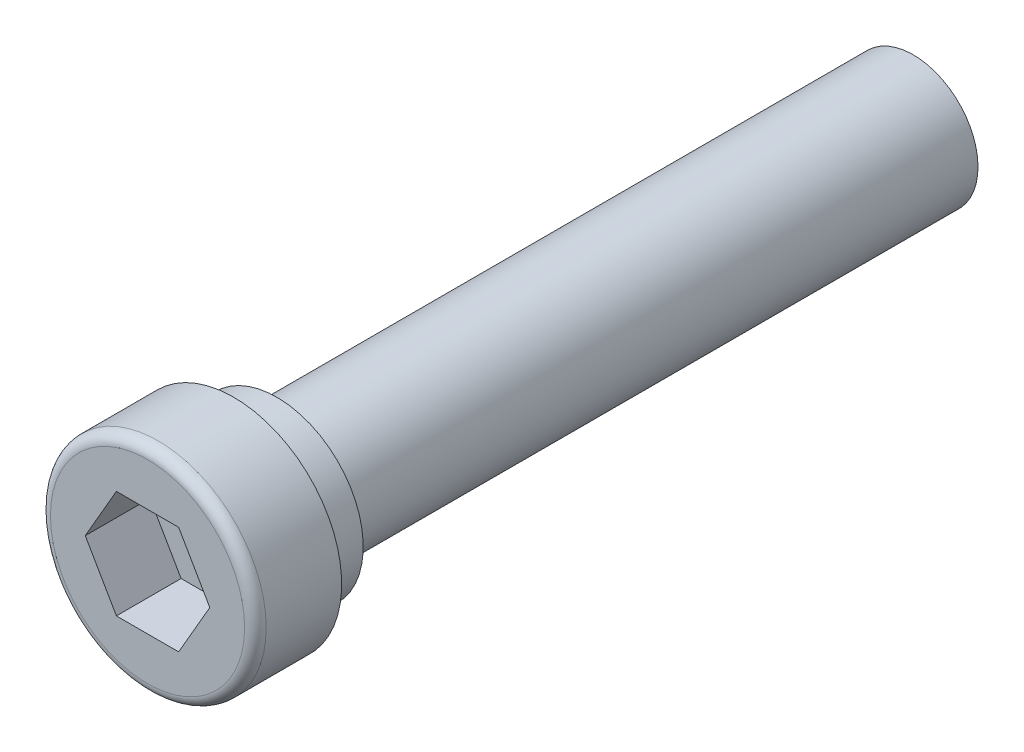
ISO-10303-21;
HEADER;
FILE_DESCRIPTION(('STEP AP214'),'2;1');
FILE_NAME('part.step','',(''),(''),'','','');
FILE_SCHEMA(('AUTOMOTIVE_DESIGN { 1 0 10303 214 1 1 1 1 }'));
ENDSEC;
DATA;
#1=APPLICATION_CONTEXT('core data for automotive mechanical design processes');
#2=APPLICATION_PROTOCOL_DEFINITION('international standard','automotive_design',2000,#1);
#3=PRODUCT_CONTEXT('',#1,'mechanical');
#4=PRODUCT('Part','Part','',(#3));
#5=PRODUCT_RELATED_PRODUCT_CATEGORY('part','',(#4));
#6=PRODUCT_DEFINITION_FORMATION('','',#4);
#7=PRODUCT_DEFINITION_CONTEXT('part definition',#1,'design');
#8=PRODUCT_DEFINITION('design','',#6,#7);
#9=PRODUCT_DEFINITION_SHAPE('','',#8);
#10=(LENGTH_UNIT() NAMED_UNIT(*) SI_UNIT(.MILLI.,.METRE.));
#11=(NAMED_UNIT(*) PLANE_ANGLE_UNIT() SI_UNIT($,.RADIAN.));
#12=(NAMED_UNIT(*) SI_UNIT($,.STERADIAN.) SOLID_ANGLE_UNIT());
#13=UNCERTAINTY_MEASURE_WITH_UNIT(LENGTH_MEASURE(1.E-05),#10,'distance_accuracy_value','');
#14=(GEOMETRIC_REPRESENTATION_CONTEXT(3) GLOBAL_UNCERTAINTY_ASSIGNED_CONTEXT((#13)) GLOBAL_UNIT_ASSIGNED_CONTEXT((#10,
#11,#12)) REPRESENTATION_CONTEXT('',''));
#15=CARTESIAN_POINT('',(0.,0.,0.));
#16=DIRECTION('',(0.,0.,1.));
#17=DIRECTION('',(1.,0.,0.));
#18=AXIS2_PLACEMENT_3D('',#15,#16,#17);
#19=CARTESIAN_POINT('',(0.,0.,0.));
#20=DIRECTION('',(0.,0.,-1.));
#21=DIRECTION('',(-1.,0.,0.));
#22=AXIS2_PLACEMENT_3D('',#19,#20,#21);
#23=PLANE('',#22);
#24=CARTESIAN_POINT('',(0.,0.,0.));
#25=DIRECTION('',(0.,0.,-1.));
#26=DIRECTION('',(-1.,0.,0.));
#27=AXIS2_PLACEMENT_3D('',#24,#25,#26);
#28=CIRCLE('',#27,3.);
#29=CARTESIAN_POINT('',(-3.,0.,0.));
#30=VERTEX_POINT('',#29);
#31=EDGE_CURVE('E145',#30,#30,#28,.T.);
#32=ORIENTED_EDGE('',*,*,#31,.F.);
#33=EDGE_LOOP('',(#32));
#34=FACE_BOUND('',#33,.T.);
#35=CARTESIAN_POINT('',(0.,0.,0.));
#36=DIRECTION('',(0.,0.,-1.));
#37=DIRECTION('',(-1.,0.,0.));
#38=AXIS2_PLACEMENT_3D('',#35,#36,#37);
#39=CIRCLE('',#38,4.);
#40=CARTESIAN_POINT('',(-4.,0.,0.));
#41=VERTEX_POINT('',#40);
#42=EDGE_CURVE('E222',#41,#41,#39,.T.);
#43=ORIENTED_EDGE('',*,*,#42,.T.);
#44=EDGE_LOOP('',(#43));
#45=FACE_BOUND('',#44,.T.);
#46=ADVANCED_FACE('F34',(#34,#45),#23,.T.);
#47=CARTESIAN_POINT('',(0.,0.,-30.));
#48=DIRECTION('',(0.,0.,-1.));
#49=DIRECTION('',(-1.,0.,0.));
#50=AXIS2_PLACEMENT_3D('',#47,#48,#49);
#51=PLANE('',#50);
#52=CARTESIAN_POINT('',(0.,0.,-30.));
#53=DIRECTION('',(0.,0.,1.));
#54=DIRECTION('',(1.,0.,0.));
#55=AXIS2_PLACEMENT_3D('',#52,#53,#54);
#56=CIRCLE('',#55,2.13397459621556);
#57=CARTESIAN_POINT('',(2.13397459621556,0.,-30.));
#58=VERTEX_POINT('',#57);
#59=EDGE_CURVE('E109',#58,#58,#56,.T.);
#60=ORIENTED_EDGE('',*,*,#59,.F.);
#61=EDGE_LOOP('',(#60));
#62=FACE_BOUND('',#61,.T.);
#63=ADVANCED_FACE('F166',(#62),#51,.T.);
#64=CARTESIAN_POINT('',(0.,0.,-29.5));
#65=DIRECTION('',(0.,0.,1.));
#66=DIRECTION('',(1.,0.,0.));
#67=AXIS2_PLACEMENT_3D('',#64,#65,#66);
#68=CONICAL_SURFACE('',#67,3.,1.04719755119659);
#69=ORIENTED_EDGE('',*,*,#59,.T.);
#70=EDGE_LOOP('',(#69));
#71=FACE_BOUND('',#70,.T.);
#72=CARTESIAN_POINT('',(0.,0.,-29.5));
#73=DIRECTION('',(0.,0.,1.));
#74=DIRECTION('',(1.,0.,0.));
#75=AXIS2_PLACEMENT_3D('',#72,#73,#74);
#76=CIRCLE('',#75,3.);
#77=CARTESIAN_POINT('',(3.,0.,-29.5));
#78=VERTEX_POINT('',#77);
#79=EDGE_CURVE('E112',#78,#78,#76,.T.);
#80=ORIENTED_EDGE('',*,*,#79,.F.);
#81=EDGE_LOOP('',(#80));
#82=FACE_BOUND('',#81,.T.);
#83=ADVANCED_FACE('F171',(#71,#82),#68,.T.);
#84=CARTESIAN_POINT('',(0.,0.,0.));
#85=DIRECTION('',(0.,0.,1.));
#86=DIRECTION('',(1.,0.,0.));
#87=AXIS2_PLACEMENT_3D('',#84,#85,#86);
#88=CYLINDRICAL_SURFACE('',#87,3.);
#89=ORIENTED_EDGE('',*,*,#79,.T.);
#90=EDGE_LOOP('',(#89));
#91=FACE_BOUND('',#90,.T.);
#92=ORIENTED_EDGE('',*,*,#31,.T.);
#93=EDGE_LOOP('',(#92));
#94=FACE_BOUND('',#93,.T.);
#95=ADVANCED_FACE('F204',(#91,#94),#88,.T.);
#96=CARTESIAN_POINT('',(0.,0.,2.));
#97=DIRECTION('',(0.,0.,-1.));
#98=DIRECTION('',(-1.,0.,0.));
#99=AXIS2_PLACEMENT_3D('',#96,#97,#98);
#100=PLANE('',#99);
#101=CARTESIAN_POINT('',(0.,0.,2.));
#102=DIRECTION('',(0.,0.,-1.));
#103=DIRECTION('',(-1.,0.,0.));
#104=AXIS2_PLACEMENT_3D('',#101,#102,#103);
#105=CIRCLE('',#104,5.);
#106=CARTESIAN_POINT('',(-5.,0.,2.));
#107=VERTEX_POINT('',#106);
#108=EDGE_CURVE('E148',#107,#107,#105,.F.);
#109=ORIENTED_EDGE('',*,*,#108,.F.);
#110=EDGE_LOOP('',(#109));
#111=FACE_BOUND('',#110,.T.);
#112=CARTESIAN_POINT('',(0.,0.,2.));
#113=DIRECTION('',(0.,0.,-1.));
#114=DIRECTION('',(-1.,0.,0.));
#115=AXIS2_PLACEMENT_3D('',#112,#113,#114);
#116=CIRCLE('',#115,4.);
#117=CARTESIAN_POINT('',(-4.,0.,2.));
#118=VERTEX_POINT('',#117);
#119=EDGE_CURVE('E150',#118,#118,#116,.T.);
#120=ORIENTED_EDGE('',*,*,#119,.F.);
#121=EDGE_LOOP('',(#120));
#122=FACE_BOUND('',#121,.T.);
#123=ADVANCED_FACE('F208',(#111,#122),#100,.T.);
#124=CARTESIAN_POINT('',(0.,0.,2.));
#125=DIRECTION('',(0.,0.,-1.));
#126=DIRECTION('',(-1.,0.,0.));
#127=AXIS2_PLACEMENT_3D('',#124,#125,#126);
#128=CYLINDRICAL_SURFACE('',#127,4.);
#129=ORIENTED_EDGE('',*,*,#119,.T.);
#130=EDGE_LOOP('',(#129));
#131=FACE_BOUND('',#130,.T.);
#132=ORIENTED_EDGE('',*,*,#42,.F.);
#133=EDGE_LOOP('',(#132));
#134=FACE_BOUND('',#133,.T.);
#135=ADVANCED_FACE('F200',(#131,#134),#128,.T.);
#136=CARTESIAN_POINT('',(2.886751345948,0.,3.));
#137=DIRECTION('',(0.,0.,1.));
#138=DIRECTION('',(1.,0.,0.));
#139=AXIS2_PLACEMENT_3D('',#136,#137,#138);
#140=PLANE('',#139);
#141=DIRECTION('',(0.5,0.866025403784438,0.));
#142=VECTOR('',#141,1.);
#143=CARTESIAN_POINT('',(1.443375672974,-2.49999999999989,3.));
#144=LINE('',#143,#142);
#145=CARTESIAN_POINT('',(1.443375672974,-2.49999999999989,3.));
#146=VERTEX_POINT('',#145);
#147=CARTESIAN_POINT('',(2.886751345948,0.,3.));
#148=VERTEX_POINT('',#147);
#149=EDGE_CURVE('E90',#146,#148,#144,.T.);
#150=ORIENTED_EDGE('',*,*,#149,.T.);
#151=DIRECTION('',(-0.5,0.866025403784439,0.));
#152=VECTOR('',#151,1.);
#153=CARTESIAN_POINT('',(2.886751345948,0.,3.));
#154=LINE('',#153,#152);
#155=CARTESIAN_POINT('',(1.443375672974,2.49999999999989,3.));
#156=VERTEX_POINT('',#155);
#157=EDGE_CURVE('E97',#148,#156,#154,.T.);
#158=ORIENTED_EDGE('',*,*,#157,.T.);
#159=DIRECTION('',(-1.,0.,0.));
#160=VECTOR('',#159,1.);
#161=CARTESIAN_POINT('',(1.443375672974,2.49999999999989,3.));
#162=LINE('',#161,#160);
#163=CARTESIAN_POINT('',(-1.443375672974,2.49999999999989,3.));
#164=VERTEX_POINT('',#163);
#165=EDGE_CURVE('E103',#156,#164,#162,.T.);
#166=ORIENTED_EDGE('',*,*,#165,.T.);
#167=DIRECTION('',(-0.5,-0.866025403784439,0.));
#168=VECTOR('',#167,1.);
#169=CARTESIAN_POINT('',(-1.443375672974,2.49999999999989,3.));
#170=LINE('',#169,#168);
#171=CARTESIAN_POINT('',(-2.886751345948,0.,3.));
#172=VERTEX_POINT('',#171);
#173=EDGE_CURVE('E117',#164,#172,#170,.T.);
#174=ORIENTED_EDGE('',*,*,#173,.T.);
#175=DIRECTION('',(0.5,-0.866025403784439,0.));
#176=VECTOR('',#175,1.);
#177=CARTESIAN_POINT('',(-2.886751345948,0.,3.));
#178=LINE('',#177,#176);
#179=CARTESIAN_POINT('',(-1.443375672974,-2.49999999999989,3.));
#180=VERTEX_POINT('',#179);
#181=EDGE_CURVE('E120',#172,#180,#178,.T.);
#182=ORIENTED_EDGE('',*,*,#181,.T.);
#183=DIRECTION('',(1.,0.,0.));
#184=VECTOR('',#183,1.);
#185=CARTESIAN_POINT('',(-1.443375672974,-2.49999999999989,3.));
#186=LINE('',#185,#184);
#187=EDGE_CURVE('E108',#180,#146,#186,.T.);
#188=ORIENTED_EDGE('',*,*,#187,.T.);
#189=EDGE_LOOP('',(#150,#158,#166,#174,#182,#188));
#190=FACE_BOUND('',#189,.T.);
#191=ADVANCED_FACE('F106',(#190),#140,.T.);
#192=CARTESIAN_POINT('',(1.443375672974,2.49999999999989,6.3));
#193=DIRECTION('',(0.,-1.,0.));
#194=DIRECTION('',(1.,0.,0.));
#195=AXIS2_PLACEMENT_3D('',#192,#193,#194);
#196=PLANE('',#195);
#197=DIRECTION('',(0.,0.,-1.));
#198=VECTOR('',#197,1.);
#199=CARTESIAN_POINT('',(-1.443375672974,2.49999999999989,6.3));
#200=LINE('',#199,#198);
#201=CARTESIAN_POINT('',(-1.443375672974,2.49999999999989,6.));
#202=VERTEX_POINT('',#201);
#203=EDGE_CURVE('E128',#202,#164,#200,.T.);
#204=ORIENTED_EDGE('',*,*,#203,.T.);
#205=ORIENTED_EDGE('',*,*,#165,.F.);
#206=DIRECTION('',(0.,0.,-1.));
#207=VECTOR('',#206,1.);
#208=CARTESIAN_POINT('',(1.443375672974,2.49999999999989,6.3));
#209=LINE('',#208,#207);
#210=CARTESIAN_POINT('',(1.443375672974,2.49999999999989,6.));
#211=VERTEX_POINT('',#210);
#212=EDGE_CURVE('E94',#211,#156,#209,.T.);
#213=ORIENTED_EDGE('',*,*,#212,.F.);
#214=DIRECTION('',(1.,0.,0.));
#215=VECTOR('',#214,1.);
#216=CARTESIAN_POINT('',(5.,2.49999999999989,6.));
#217=LINE('',#216,#215);
#218=EDGE_CURVE('E139',#202,#211,#217,.T.);
#219=ORIENTED_EDGE('',*,*,#218,.F.);
#220=EDGE_LOOP('',(#204,#205,#213,#219));
#221=FACE_BOUND('',#220,.T.);
#222=ADVANCED_FACE('F185',(#221),#196,.T.);
#223=CARTESIAN_POINT('',(-1.443375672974,2.49999999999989,6.3));
#224=DIRECTION('',(0.866025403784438,-0.5,0.));
#225=DIRECTION('',(0.5,0.866025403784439,0.));
#226=AXIS2_PLACEMENT_3D('',#223,#224,#225);
#227=PLANE('',#226);
#228=DIRECTION('',(0.,0.,-1.));
#229=VECTOR('',#228,1.);
#230=CARTESIAN_POINT('',(-2.886751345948,0.,6.3));
#231=LINE('',#230,#229);
#232=CARTESIAN_POINT('',(-2.886751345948,0.,6.));
#233=VERTEX_POINT('',#232);
#234=EDGE_CURVE('E126',#233,#172,#231,.T.);
#235=ORIENTED_EDGE('',*,*,#234,.T.);
#236=ORIENTED_EDGE('',*,*,#173,.F.);
#237=ORIENTED_EDGE('',*,*,#203,.F.);
#238=DIRECTION('',(0.5,0.866025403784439,0.));
#239=VECTOR('',#238,1.);
#240=CARTESIAN_POINT('',(-0.915063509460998,3.41506350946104,6.));
#241=LINE('',#240,#239);
#242=EDGE_CURVE('E136',#233,#202,#241,.T.);
#243=ORIENTED_EDGE('',*,*,#242,.F.);
#244=EDGE_LOOP('',(#235,#236,#237,#243));
#245=FACE_BOUND('',#244,.T.);
#246=ADVANCED_FACE('F188',(#245),#227,.T.);
#247=CARTESIAN_POINT('',(-2.886751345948,0.,6.3));
#248=DIRECTION('',(0.866025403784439,0.5,0.));
#249=DIRECTION('',(-0.5,0.866025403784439,0.));
#250=AXIS2_PLACEMENT_3D('',#247,#248,#249);
#251=PLANE('',#250);
#252=DIRECTION('',(0.,0.,-1.));
#253=VECTOR('',#252,1.);
#254=CARTESIAN_POINT('',(-1.443375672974,-2.49999999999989,6.3));
#255=LINE('',#254,#253);
#256=CARTESIAN_POINT('',(-1.443375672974,-2.49999999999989,6.));
#257=VERTEX_POINT('',#256);
#258=EDGE_CURVE('E49',#257,#180,#255,.T.);
#259=ORIENTED_EDGE('',*,*,#258,.T.);
#260=ORIENTED_EDGE('',*,*,#181,.F.);
#261=ORIENTED_EDGE('',*,*,#234,.F.);
#262=DIRECTION('',(-0.5,0.866025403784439,0.));
#263=VECTOR('',#262,1.);
#264=CARTESIAN_POINT('',(-0.915063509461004,-3.41506350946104,6.));
#265=LINE('',#264,#263);
#266=EDGE_CURVE('E133',#257,#233,#265,.T.);
#267=ORIENTED_EDGE('',*,*,#266,.F.);
#268=EDGE_LOOP('',(#259,#260,#261,#267));
#269=FACE_BOUND('',#268,.T.);
#270=ADVANCED_FACE('F192',(#269),#251,.T.);
#271=CARTESIAN_POINT('',(-1.443375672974,-2.49999999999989,6.3));
#272=DIRECTION('',(0.,1.,0.));
#273=DIRECTION('',(-1.,0.,0.));
#274=AXIS2_PLACEMENT_3D('',#271,#272,#273);
#275=PLANE('',#274);
#276=DIRECTION('',(0.,0.,-1.));
#277=VECTOR('',#276,1.);
#278=CARTESIAN_POINT('',(1.443375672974,-2.49999999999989,6.3));
#279=LINE('',#278,#277);
#280=CARTESIAN_POINT('',(1.443375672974,-2.49999999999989,6.));
#281=VERTEX_POINT('',#280);
#282=EDGE_CURVE('E123',#281,#146,#279,.T.);
#283=ORIENTED_EDGE('',*,*,#282,.T.);
#284=ORIENTED_EDGE('',*,*,#187,.F.);
#285=ORIENTED_EDGE('',*,*,#258,.F.);
#286=DIRECTION('',(-1.,0.,0.));
#287=VECTOR('',#286,1.);
#288=CARTESIAN_POINT('',(5.,-2.49999999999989,6.));
#289=LINE('',#288,#287);
#290=EDGE_CURVE('E93',#281,#257,#289,.T.);
#291=ORIENTED_EDGE('',*,*,#290,.F.);
#292=EDGE_LOOP('',(#283,#284,#285,#291));
#293=FACE_BOUND('',#292,.T.);
#294=ADVANCED_FACE('F182',(#293),#275,.T.);
#295=CARTESIAN_POINT('',(1.443375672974,-2.49999999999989,6.3));
#296=DIRECTION('',(-0.866025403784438,0.5,0.));
#297=DIRECTION('',(-0.5,-0.866025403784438,0.));
#298=AXIS2_PLACEMENT_3D('',#295,#296,#297);
#299=PLANE('',#298);
#300=DIRECTION('',(0.,0.,-1.));
#301=VECTOR('',#300,1.);
#302=CARTESIAN_POINT('',(2.886751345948,0.,6.3));
#303=LINE('',#302,#301);
#304=CARTESIAN_POINT('',(2.886751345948,0.,6.));
#305=VERTEX_POINT('',#304);
#306=EDGE_CURVE('E86',#305,#148,#303,.T.);
#307=ORIENTED_EDGE('',*,*,#306,.T.);
#308=ORIENTED_EDGE('',*,*,#149,.F.);
#309=ORIENTED_EDGE('',*,*,#282,.F.);
#310=DIRECTION('',(-0.5,-0.866025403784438,0.));
#311=VECTOR('',#310,1.);
#312=CARTESIAN_POINT('',(3.415063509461,0.915063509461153,6.));
#313=LINE('',#312,#311);
#314=EDGE_CURVE('E57',#305,#281,#313,.T.);
#315=ORIENTED_EDGE('',*,*,#314,.F.);
#316=EDGE_LOOP('',(#307,#308,#309,#315));
#317=FACE_BOUND('',#316,.T.);
#318=ADVANCED_FACE('F88',(#317),#299,.T.);
#319=CARTESIAN_POINT('',(2.886751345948,0.,6.3));
#320=DIRECTION('',(-0.866025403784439,-0.5,0.));
#321=DIRECTION('',(0.5,-0.866025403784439,0.));
#322=AXIS2_PLACEMENT_3D('',#319,#320,#321);
#323=PLANE('',#322);
#324=ORIENTED_EDGE('',*,*,#212,.T.);
#325=ORIENTED_EDGE('',*,*,#157,.F.);
#326=ORIENTED_EDGE('',*,*,#306,.F.);
#327=DIRECTION('',(0.5,-0.866025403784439,0.));
#328=VECTOR('',#327,1.);
#329=CARTESIAN_POINT('',(3.415063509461,-0.915063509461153,6.));
#330=LINE('',#329,#328);
#331=EDGE_CURVE('E142',#211,#305,#330,.T.);
#332=ORIENTED_EDGE('',*,*,#331,.F.);
#333=EDGE_LOOP('',(#324,#325,#326,#332));
#334=FACE_BOUND('',#333,.T.);
#335=ADVANCED_FACE('F98',(#334),#323,.T.);
#336=CARTESIAN_POINT('',(5.,0.,6.));
#337=DIRECTION('',(0.,0.,1.));
#338=DIRECTION('',(1.,0.,0.));
#339=AXIS2_PLACEMENT_3D('',#336,#337,#338);
#340=PLANE('',#339);
#341=CARTESIAN_POINT('',(0.,0.,6.));
#342=DIRECTION('',(0.,0.,1.));
#343=DIRECTION('',(1.,0.,0.));
#344=AXIS2_PLACEMENT_3D('',#341,#342,#343);
#345=CIRCLE('',#344,4.5);
#346=CARTESIAN_POINT('',(4.5,0.,6.));
#347=VERTEX_POINT('',#346);
#348=EDGE_CURVE('E12',#347,#347,#345,.T.);
#349=ORIENTED_EDGE('',*,*,#348,.T.);
#350=EDGE_LOOP('',(#349));
#351=FACE_BOUND('',#350,.T.);
#352=ORIENTED_EDGE('',*,*,#331,.T.);
#353=ORIENTED_EDGE('',*,*,#314,.T.);
#354=ORIENTED_EDGE('',*,*,#290,.T.);
#355=ORIENTED_EDGE('',*,*,#266,.T.);
#356=ORIENTED_EDGE('',*,*,#242,.T.);
#357=ORIENTED_EDGE('',*,*,#218,.T.);
#358=EDGE_LOOP('',(#352,#353,#354,#355,#356,#357));
#359=FACE_BOUND('',#358,.T.);
#360=ADVANCED_FACE('F162',(#351,#359),#340,.T.);
#361=CARTESIAN_POINT('',(0.,0.,0.));
#362=DIRECTION('',(0.,0.,-1.));
#363=DIRECTION('',(-1.,0.,0.));
#364=AXIS2_PLACEMENT_3D('',#361,#362,#363);
#365=CYLINDRICAL_SURFACE('',#364,5.);
#366=CARTESIAN_POINT('',(0.,0.,5.5));
#367=DIRECTION('',(0.,0.,1.));
#368=DIRECTION('',(1.,0.,0.));
#369=AXIS2_PLACEMENT_3D('',#366,#367,#368);
#370=CIRCLE('',#369,5.);
#371=CARTESIAN_POINT('',(5.,0.,5.5));
#372=VERTEX_POINT('',#371);
#373=EDGE_CURVE('E42',#372,#372,#370,.F.);
#374=ORIENTED_EDGE('',*,*,#373,.T.);
#375=EDGE_LOOP('',(#374));
#376=FACE_BOUND('',#375,.T.);
#377=ORIENTED_EDGE('',*,*,#108,.T.);
#378=EDGE_LOOP('',(#377));
#379=FACE_BOUND('',#378,.T.);
#380=ADVANCED_FACE('F154',(#376,#379),#365,.T.);
#381=CARTESIAN_POINT('',(0.,0.,5.5));
#382=DIRECTION('',(0.,0.,1.));
#383=DIRECTION('',(1.,0.,0.));
#384=AXIS2_PLACEMENT_3D('',#381,#382,#383);
#385=TOROIDAL_SURFACE('',#384,4.5,0.5);
#386=ORIENTED_EDGE('',*,*,#348,.F.);
#387=EDGE_LOOP('',(#386));
#388=FACE_BOUND('',#387,.T.);
#389=ORIENTED_EDGE('',*,*,#373,.F.);
#390=EDGE_LOOP('',(#389));
#391=FACE_BOUND('',#390,.T.);
#392=ADVANCED_FACE('F36',(#388,#391),#385,.T.);
#393=CLOSED_SHELL('',(#46,#63,#83,#95,#123,#135,#191,#222,#246,#270,#294,#318,#335,#360,#380,#392));
#394=MANIFOLD_SOLID_BREP('B2',#393);
#395=ADVANCED_BREP_SHAPE_REPRESENTATION('',(#18,#394),#14);
#396=SHAPE_DEFINITION_REPRESENTATION(#9,#395);
ENDSEC;
END-ISO-10303-21;
